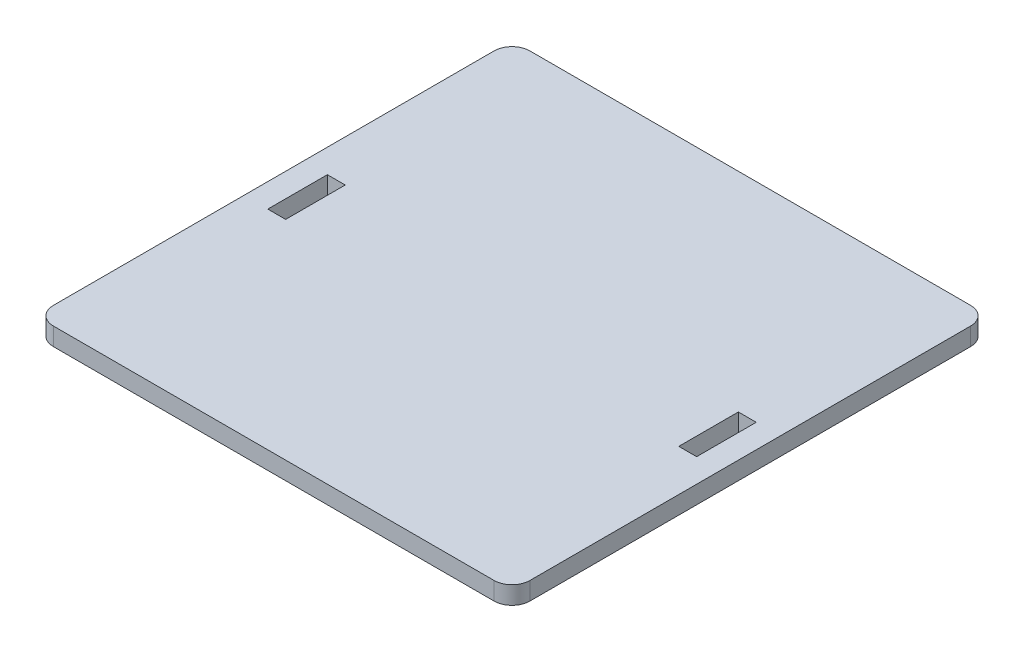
from build123d import *

# Parameters (mm, degrees)
SKETCH1_W           = 6
SKETCH1_H           = 20
BOSS_EXTRUDE1_DEPTH = 6


with BuildPart() as part:
    # Sketch1 → Boss-Extrude1 (new body)
    with BuildSketch(Plane(origin=(0, 0, 0), x_dir=(1, 0, 0), z_dir=(0, 1, 0))):
        with BuildLine():
            Line((-74, 0), (74, 0))
            ThreePointArc((74, 0), (78.242640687, 1.757359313), (80, 6))
            Line((80, 6), (80, 154))
            ThreePointArc((80, 154), (78.242640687, 158.242640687), (74, 160))
            Line((74, 160), (-74, 160))
            ThreePointArc((-74, 160), (-78.242640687, 158.242640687), (-80, 154))
            Line((-80, 154), (-80, 6))
            ThreePointArc((-80, 6), (-78.242640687, 1.757359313), (-74, 0))
        make_face()
        with Locations((-69, 80)):
            Rectangle(SKETCH1_W, SKETCH1_H, mode=Mode.SUBTRACT)
        with Locations((69, 80)):
            Rectangle(SKETCH1_W, SKETCH1_H, mode=Mode.SUBTRACT)
    extrude(amount=BOSS_EXTRUDE1_DEPTH)


solid = part.part
